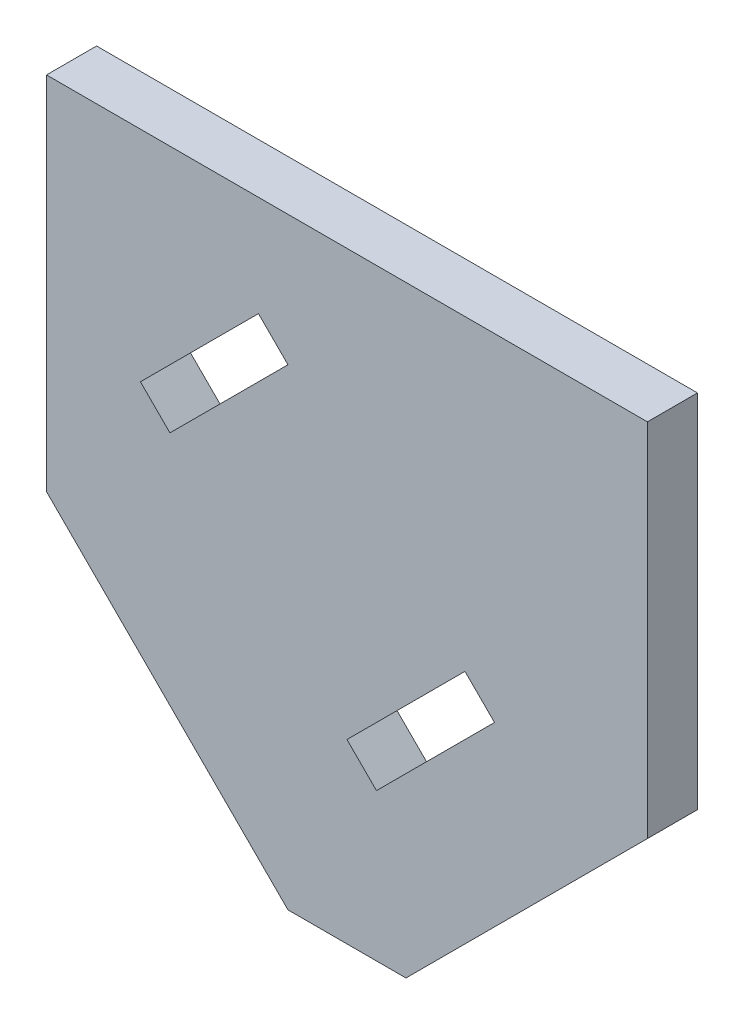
ISO-10303-21;
HEADER;
FILE_DESCRIPTION(('STEP AP214'),'2;1');
FILE_NAME('part.step','',(''),(''),'','','');
FILE_SCHEMA(('AUTOMOTIVE_DESIGN { 1 0 10303 214 1 1 1 1 }'));
ENDSEC;
DATA;
#1=APPLICATION_CONTEXT('core data for automotive mechanical design processes');
#2=APPLICATION_PROTOCOL_DEFINITION('international standard','automotive_design',2000,#1);
#3=PRODUCT_CONTEXT('',#1,'mechanical');
#4=PRODUCT('Part','Part','',(#3));
#5=PRODUCT_RELATED_PRODUCT_CATEGORY('part','',(#4));
#6=PRODUCT_DEFINITION_FORMATION('','',#4);
#7=PRODUCT_DEFINITION_CONTEXT('part definition',#1,'design');
#8=PRODUCT_DEFINITION('design','',#6,#7);
#9=PRODUCT_DEFINITION_SHAPE('','',#8);
#10=(LENGTH_UNIT() NAMED_UNIT(*) SI_UNIT(.MILLI.,.METRE.));
#11=(NAMED_UNIT(*) PLANE_ANGLE_UNIT() SI_UNIT($,.RADIAN.));
#12=(NAMED_UNIT(*) SI_UNIT($,.STERADIAN.) SOLID_ANGLE_UNIT());
#13=UNCERTAINTY_MEASURE_WITH_UNIT(LENGTH_MEASURE(1.E-05),#10,'distance_accuracy_value','');
#14=(GEOMETRIC_REPRESENTATION_CONTEXT(3) GLOBAL_UNCERTAINTY_ASSIGNED_CONTEXT((#13)) GLOBAL_UNIT_ASSIGNED_CONTEXT((#10,
#11,#12)) REPRESENTATION_CONTEXT('',''));
#15=CARTESIAN_POINT('',(0.,0.,0.));
#16=DIRECTION('',(0.,0.,1.));
#17=DIRECTION('',(1.,0.,0.));
#18=AXIS2_PLACEMENT_3D('',#15,#16,#17);
#19=CARTESIAN_POINT('',(-18.,21.6256246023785,3.));
#20=DIRECTION('',(1.,0.,0.));
#21=DIRECTION('',(0.,1.,0.));
#22=AXIS2_PLACEMENT_3D('',#19,#20,#21);
#23=PLANE('',#22);
#24=DIRECTION('',(0.,-1.,0.));
#25=VECTOR('',#24,1.);
#26=CARTESIAN_POINT('',(-18.,21.6256246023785,0.));
#27=LINE('',#26,#25);
#28=CARTESIAN_POINT('',(-18.,21.6256246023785,0.));
#29=VERTEX_POINT('',#28);
#30=CARTESIAN_POINT('',(-18.,1.97758476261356E-13,0.));
#31=VERTEX_POINT('',#30);
#32=EDGE_CURVE('E175',#29,#31,#27,.T.);
#33=ORIENTED_EDGE('',*,*,#32,.T.);
#34=DIRECTION('',(0.,0.,-1.));
#35=VECTOR('',#34,1.);
#36=CARTESIAN_POINT('',(-18.,1.97758476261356E-13,3.));
#37=LINE('',#36,#35);
#38=CARTESIAN_POINT('',(-18.,1.97758476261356E-13,3.));
#39=VERTEX_POINT('',#38);
#40=EDGE_CURVE('E241',#39,#31,#37,.T.);
#41=ORIENTED_EDGE('',*,*,#40,.F.);
#42=DIRECTION('',(0.,-1.,0.));
#43=VECTOR('',#42,1.);
#44=CARTESIAN_POINT('',(-18.,21.6256246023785,3.));
#45=LINE('',#44,#43);
#46=CARTESIAN_POINT('',(-18.,21.6256246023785,3.));
#47=VERTEX_POINT('',#46);
#48=EDGE_CURVE('E210',#47,#39,#45,.T.);
#49=ORIENTED_EDGE('',*,*,#48,.F.);
#50=DIRECTION('',(0.,0.,-1.));
#51=VECTOR('',#50,1.);
#52=CARTESIAN_POINT('',(-18.,21.6256246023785,3.));
#53=LINE('',#52,#51);
#54=EDGE_CURVE('E222',#47,#29,#53,.T.);
#55=ORIENTED_EDGE('',*,*,#54,.T.);
#56=EDGE_LOOP('',(#33,#41,#49,#55));
#57=FACE_BOUND('',#56,.T.);
#58=ADVANCED_FACE('F35',(#57),#23,.F.);
#59=CARTESIAN_POINT('',(-18.,1.97758476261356E-13,3.));
#60=DIRECTION('',(0.707106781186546,0.707106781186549,0.));
#61=DIRECTION('',(-0.707106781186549,0.707106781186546,0.));
#62=AXIS2_PLACEMENT_3D('',#59,#60,#61);
#63=PLANE('',#62);
#64=DIRECTION('',(0.707106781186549,-0.707106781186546,0.));
#65=VECTOR('',#64,1.);
#66=CARTESIAN_POINT('',(-18.,1.97758476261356E-13,0.));
#67=LINE('',#66,#65);
#68=CARTESIAN_POINT('',(-3.53553390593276,-14.464466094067,0.));
#69=VERTEX_POINT('',#68);
#70=EDGE_CURVE('E225',#31,#69,#67,.T.);
#71=ORIENTED_EDGE('',*,*,#70,.T.);
#72=DIRECTION('',(0.,0.,1.));
#73=VECTOR('',#72,1.);
#74=CARTESIAN_POINT('',(-3.53553390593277,-14.464466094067,3.));
#75=LINE('',#74,#73);
#76=CARTESIAN_POINT('',(-3.53553390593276,-14.464466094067,3.));
#77=VERTEX_POINT('',#76);
#78=EDGE_CURVE('E43',#69,#77,#75,.T.);
#79=ORIENTED_EDGE('',*,*,#78,.T.);
#80=DIRECTION('',(0.707106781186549,-0.707106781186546,0.));
#81=VECTOR('',#80,1.);
#82=CARTESIAN_POINT('',(-18.,1.97758476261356E-13,3.));
#83=LINE('',#82,#81);
#84=EDGE_CURVE('E213',#39,#77,#83,.T.);
#85=ORIENTED_EDGE('',*,*,#84,.F.);
#86=ORIENTED_EDGE('',*,*,#40,.T.);
#87=EDGE_LOOP('',(#71,#79,#85,#86));
#88=FACE_BOUND('',#87,.T.);
#89=ADVANCED_FACE('F275',(#88),#63,.F.);
#90=CARTESIAN_POINT('',(0.,-17.9999999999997,3.));
#91=DIRECTION('',(-0.707106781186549,0.707106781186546,0.));
#92=DIRECTION('',(-0.707106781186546,-0.707106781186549,0.));
#93=AXIS2_PLACEMENT_3D('',#90,#91,#92);
#94=PLANE('',#93);
#95=DIRECTION('',(0.707106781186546,0.707106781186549,0.));
#96=VECTOR('',#95,1.);
#97=CARTESIAN_POINT('',(0.,-17.9999999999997,3.));
#98=LINE('',#97,#96);
#99=CARTESIAN_POINT('',(3.53553390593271,-14.464466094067,3.));
#100=VERTEX_POINT('',#99);
#101=CARTESIAN_POINT('',(18.,3.71230823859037E-13,3.));
#102=VERTEX_POINT('',#101);
#103=EDGE_CURVE('E216',#100,#102,#98,.T.);
#104=ORIENTED_EDGE('',*,*,#103,.F.);
#105=DIRECTION('',(0.,0.,-1.));
#106=VECTOR('',#105,1.);
#107=CARTESIAN_POINT('',(3.53553390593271,-14.464466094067,3.));
#108=LINE('',#107,#106);
#109=CARTESIAN_POINT('',(3.53553390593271,-14.464466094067,0.));
#110=VERTEX_POINT('',#109);
#111=EDGE_CURVE('E244',#100,#110,#108,.T.);
#112=ORIENTED_EDGE('',*,*,#111,.T.);
#113=DIRECTION('',(0.707106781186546,0.707106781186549,0.));
#114=VECTOR('',#113,1.);
#115=CARTESIAN_POINT('',(0.,-17.9999999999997,0.));
#116=LINE('',#115,#114);
#117=CARTESIAN_POINT('',(18.,3.71230823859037E-13,0.));
#118=VERTEX_POINT('',#117);
#119=EDGE_CURVE('E227',#110,#118,#116,.T.);
#120=ORIENTED_EDGE('',*,*,#119,.T.);
#121=DIRECTION('',(0.,0.,-1.));
#122=VECTOR('',#121,1.);
#123=CARTESIAN_POINT('',(18.,3.71230823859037E-13,3.));
#124=LINE('',#123,#122);
#125=EDGE_CURVE('E238',#102,#118,#124,.T.);
#126=ORIENTED_EDGE('',*,*,#125,.F.);
#127=EDGE_LOOP('',(#104,#112,#120,#126));
#128=FACE_BOUND('',#127,.T.);
#129=ADVANCED_FACE('F250',(#128),#94,.F.);
#130=CARTESIAN_POINT('',(18.,3.71230823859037E-13,3.));
#131=DIRECTION('',(-1.,0.,0.));
#132=DIRECTION('',(0.,0.,1.));
#133=AXIS2_PLACEMENT_3D('',#130,#131,#132);
#134=PLANE('',#133);
#135=DIRECTION('',(0.,1.,0.));
#136=VECTOR('',#135,1.);
#137=CARTESIAN_POINT('',(18.,3.71230823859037E-13,0.));
#138=LINE('',#137,#136);
#139=CARTESIAN_POINT('',(18.,21.6256246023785,0.));
#140=VERTEX_POINT('',#139);
#141=EDGE_CURVE('E229',#118,#140,#138,.T.);
#142=ORIENTED_EDGE('',*,*,#141,.T.);
#143=DIRECTION('',(0.,0.,-1.));
#144=VECTOR('',#143,1.);
#145=CARTESIAN_POINT('',(18.,21.6256246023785,3.));
#146=LINE('',#145,#144);
#147=CARTESIAN_POINT('',(18.,21.6256246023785,3.));
#148=VERTEX_POINT('',#147);
#149=EDGE_CURVE('E235',#148,#140,#146,.T.);
#150=ORIENTED_EDGE('',*,*,#149,.F.);
#151=DIRECTION('',(0.,1.,0.));
#152=VECTOR('',#151,1.);
#153=CARTESIAN_POINT('',(18.,3.71230823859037E-13,3.));
#154=LINE('',#153,#152);
#155=EDGE_CURVE('E218',#102,#148,#154,.T.);
#156=ORIENTED_EDGE('',*,*,#155,.F.);
#157=ORIENTED_EDGE('',*,*,#125,.T.);
#158=EDGE_LOOP('',(#142,#150,#156,#157));
#159=FACE_BOUND('',#158,.T.);
#160=ADVANCED_FACE('F258',(#159),#134,.F.);
#161=CARTESIAN_POINT('',(-18.,21.6256246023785,3.));
#162=DIRECTION('',(0.,-1.,0.));
#163=DIRECTION('',(1.,0.,0.));
#164=AXIS2_PLACEMENT_3D('',#161,#162,#163);
#165=PLANE('',#164);
#166=DIRECTION('',(-1.,0.,0.));
#167=VECTOR('',#166,1.);
#168=CARTESIAN_POINT('',(-18.,21.6256246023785,0.));
#169=LINE('',#168,#167);
#170=EDGE_CURVE('E214',#140,#29,#169,.T.);
#171=ORIENTED_EDGE('',*,*,#170,.T.);
#172=ORIENTED_EDGE('',*,*,#54,.F.);
#173=DIRECTION('',(-1.,0.,0.));
#174=VECTOR('',#173,1.);
#175=CARTESIAN_POINT('',(18.,21.6256246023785,3.));
#176=LINE('',#175,#174);
#177=EDGE_CURVE('E220',#148,#47,#176,.T.);
#178=ORIENTED_EDGE('',*,*,#177,.F.);
#179=ORIENTED_EDGE('',*,*,#149,.T.);
#180=EDGE_LOOP('',(#171,#172,#178,#179));
#181=FACE_BOUND('',#180,.T.);
#182=ADVANCED_FACE('F262',(#181),#165,.F.);
#183=CARTESIAN_POINT('',(0.,0.,3.));
#184=DIRECTION('',(0.,0.,-1.));
#185=DIRECTION('',(-1.,0.,0.));
#186=AXIS2_PLACEMENT_3D('',#183,#184,#185);
#187=PLANE('',#186);
#188=DIRECTION('',(-0.707106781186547,-0.707106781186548,0.));
#189=VECTOR('',#188,1.);
#190=CARTESIAN_POINT('',(7.07106781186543,3.21320343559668,3.));
#191=LINE('',#190,#189);
#192=CARTESIAN_POINT('',(7.07106781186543,3.21320343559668,3.));
#193=VERTEX_POINT('',#192);
#194=CARTESIAN_POINT('',(0.,-3.8578643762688,3.));
#195=VERTEX_POINT('',#194);
#196=EDGE_CURVE('E168',#193,#195,#191,.T.);
#197=ORIENTED_EDGE('',*,*,#196,.F.);
#198=DIRECTION('',(-0.707106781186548,0.707106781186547,0.));
#199=VECTOR('',#198,1.);
#200=CARTESIAN_POINT('',(8.83883476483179,1.44543648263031,3.));
#201=LINE('',#200,#199);
#202=CARTESIAN_POINT('',(8.83883476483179,1.44543648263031,3.));
#203=VERTEX_POINT('',#202);
#204=EDGE_CURVE('E141',#203,#193,#201,.T.);
#205=ORIENTED_EDGE('',*,*,#204,.F.);
#206=DIRECTION('',(0.707106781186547,0.707106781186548,0.));
#207=VECTOR('',#206,1.);
#208=CARTESIAN_POINT('',(8.83883476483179,1.44543648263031,3.));
#209=LINE('',#208,#207);
#210=CARTESIAN_POINT('',(1.76776695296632,-5.62563132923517,3.));
#211=VERTEX_POINT('',#210);
#212=EDGE_CURVE('E159',#211,#203,#209,.T.);
#213=ORIENTED_EDGE('',*,*,#212,.F.);
#214=DIRECTION('',(0.707106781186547,-0.707106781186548,0.));
#215=VECTOR('',#214,1.);
#216=CARTESIAN_POINT('',(0.,-3.8578643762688,3.));
#217=LINE('',#216,#215);
#218=EDGE_CURVE('E162',#195,#211,#217,.T.);
#219=ORIENTED_EDGE('',*,*,#218,.F.);
#220=EDGE_LOOP('',(#197,#205,#213,#219));
#221=FACE_BOUND('',#220,.T.);
#222=DIRECTION('',(0.707106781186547,0.707106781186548,0.));
#223=VECTOR('',#222,1.);
#224=CARTESIAN_POINT('',(-3.53553390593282,13.8198051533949,3.));
#225=LINE('',#224,#223);
#226=CARTESIAN_POINT('',(-10.6066017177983,6.74873734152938,3.));
#227=VERTEX_POINT('',#226);
#228=CARTESIAN_POINT('',(-3.53553390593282,13.8198051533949,3.));
#229=VERTEX_POINT('',#228);
#230=EDGE_CURVE('E195',#227,#229,#225,.T.);
#231=ORIENTED_EDGE('',*,*,#230,.F.);
#232=DIRECTION('',(0.707106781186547,-0.707106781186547,0.));
#233=VECTOR('',#232,1.);
#234=CARTESIAN_POINT('',(-10.6066017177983,6.74873734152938,3.));
#235=LINE('',#234,#233);
#236=CARTESIAN_POINT('',(-12.3743686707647,8.51650429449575,3.));
#237=VERTEX_POINT('',#236);
#238=EDGE_CURVE('E193',#237,#227,#235,.T.);
#239=ORIENTED_EDGE('',*,*,#238,.F.);
#240=DIRECTION('',(-0.707106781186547,-0.707106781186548,0.));
#241=VECTOR('',#240,1.);
#242=CARTESIAN_POINT('',(-12.3743686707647,8.51650429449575,3.));
#243=LINE('',#242,#241);
#244=CARTESIAN_POINT('',(-5.30330085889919,15.5875721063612,3.));
#245=VERTEX_POINT('',#244);
#246=EDGE_CURVE('E183',#245,#237,#243,.T.);
#247=ORIENTED_EDGE('',*,*,#246,.F.);
#248=DIRECTION('',(-0.707106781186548,0.707106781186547,0.));
#249=VECTOR('',#248,1.);
#250=CARTESIAN_POINT('',(-5.30330085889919,15.5875721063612,3.));
#251=LINE('',#250,#249);
#252=EDGE_CURVE('E198',#229,#245,#251,.T.);
#253=ORIENTED_EDGE('',*,*,#252,.F.);
#254=EDGE_LOOP('',(#231,#239,#247,#253));
#255=FACE_BOUND('',#254,.T.);
#256=ORIENTED_EDGE('',*,*,#84,.T.);
#257=DIRECTION('',(-1.,0.,0.));
#258=VECTOR('',#257,1.);
#259=CARTESIAN_POINT('',(3.53553390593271,-14.464466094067,3.));
#260=LINE('',#259,#258);
#261=EDGE_CURVE('E11',#77,#100,#260,.F.);
#262=ORIENTED_EDGE('',*,*,#261,.T.);
#263=ORIENTED_EDGE('',*,*,#103,.T.);
#264=ORIENTED_EDGE('',*,*,#155,.T.);
#265=ORIENTED_EDGE('',*,*,#177,.T.);
#266=ORIENTED_EDGE('',*,*,#48,.T.);
#267=EDGE_LOOP('',(#256,#262,#263,#264,#265,#266));
#268=FACE_BOUND('',#267,.T.);
#269=ADVANCED_FACE('F266',(#221,#255,#268),#187,.F.);
#270=CARTESIAN_POINT('',(0.,0.,0.));
#271=DIRECTION('',(0.,0.,-1.));
#272=DIRECTION('',(-1.,0.,0.));
#273=AXIS2_PLACEMENT_3D('',#270,#271,#272);
#274=PLANE('',#273);
#275=DIRECTION('',(-0.707106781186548,0.707106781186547,0.));
#276=VECTOR('',#275,1.);
#277=CARTESIAN_POINT('',(8.83883476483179,1.44543648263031,0.));
#278=LINE('',#277,#276);
#279=CARTESIAN_POINT('',(8.83883476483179,1.44543648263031,0.));
#280=VERTEX_POINT('',#279);
#281=CARTESIAN_POINT('',(7.07106781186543,3.21320343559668,0.));
#282=VERTEX_POINT('',#281);
#283=EDGE_CURVE('E138',#280,#282,#278,.T.);
#284=ORIENTED_EDGE('',*,*,#283,.T.);
#285=DIRECTION('',(-0.707106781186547,-0.707106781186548,0.));
#286=VECTOR('',#285,1.);
#287=CARTESIAN_POINT('',(7.07106781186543,3.21320343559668,0.));
#288=LINE('',#287,#286);
#289=CARTESIAN_POINT('',(0.,-3.8578643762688,0.));
#290=VERTEX_POINT('',#289);
#291=EDGE_CURVE('E150',#282,#290,#288,.T.);
#292=ORIENTED_EDGE('',*,*,#291,.T.);
#293=DIRECTION('',(0.707106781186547,-0.707106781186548,0.));
#294=VECTOR('',#293,1.);
#295=CARTESIAN_POINT('',(0.,-3.8578643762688,0.));
#296=LINE('',#295,#294);
#297=CARTESIAN_POINT('',(1.76776695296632,-5.62563132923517,0.));
#298=VERTEX_POINT('',#297);
#299=EDGE_CURVE('E154',#290,#298,#296,.T.);
#300=ORIENTED_EDGE('',*,*,#299,.T.);
#301=DIRECTION('',(0.707106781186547,0.707106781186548,0.));
#302=VECTOR('',#301,1.);
#303=CARTESIAN_POINT('',(8.83883476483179,1.44543648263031,0.));
#304=LINE('',#303,#302);
#305=EDGE_CURVE('E146',#298,#280,#304,.T.);
#306=ORIENTED_EDGE('',*,*,#305,.T.);
#307=EDGE_LOOP('',(#284,#292,#300,#306));
#308=FACE_BOUND('',#307,.T.);
#309=DIRECTION('',(0.707106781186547,-0.707106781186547,0.));
#310=VECTOR('',#309,1.);
#311=CARTESIAN_POINT('',(-10.6066017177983,6.74873734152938,0.));
#312=LINE('',#311,#310);
#313=CARTESIAN_POINT('',(-12.3743686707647,8.51650429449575,0.));
#314=VERTEX_POINT('',#313);
#315=CARTESIAN_POINT('',(-10.6066017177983,6.74873734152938,0.));
#316=VERTEX_POINT('',#315);
#317=EDGE_CURVE('E179',#314,#316,#312,.T.);
#318=ORIENTED_EDGE('',*,*,#317,.T.);
#319=DIRECTION('',(0.707106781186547,0.707106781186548,0.));
#320=VECTOR('',#319,1.);
#321=CARTESIAN_POINT('',(-3.53553390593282,13.8198051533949,0.));
#322=LINE('',#321,#320);
#323=CARTESIAN_POINT('',(-3.53553390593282,13.8198051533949,0.));
#324=VERTEX_POINT('',#323);
#325=EDGE_CURVE('E182',#316,#324,#322,.T.);
#326=ORIENTED_EDGE('',*,*,#325,.T.);
#327=DIRECTION('',(-0.707106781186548,0.707106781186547,0.));
#328=VECTOR('',#327,1.);
#329=CARTESIAN_POINT('',(-5.30330085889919,15.5875721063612,0.));
#330=LINE('',#329,#328);
#331=CARTESIAN_POINT('',(-5.30330085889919,15.5875721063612,0.));
#332=VERTEX_POINT('',#331);
#333=EDGE_CURVE('E186',#324,#332,#330,.T.);
#334=ORIENTED_EDGE('',*,*,#333,.T.);
#335=DIRECTION('',(-0.707106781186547,-0.707106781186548,0.));
#336=VECTOR('',#335,1.);
#337=CARTESIAN_POINT('',(-12.3743686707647,8.51650429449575,0.));
#338=LINE('',#337,#336);
#339=EDGE_CURVE('E189',#332,#314,#338,.T.);
#340=ORIENTED_EDGE('',*,*,#339,.T.);
#341=EDGE_LOOP('',(#318,#326,#334,#340));
#342=FACE_BOUND('',#341,.T.);
#343=ORIENTED_EDGE('',*,*,#119,.F.);
#344=DIRECTION('',(1.,0.,0.));
#345=VECTOR('',#344,1.);
#346=CARTESIAN_POINT('',(0.,-14.464466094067,0.));
#347=LINE('',#346,#345);
#348=EDGE_CURVE('E57',#110,#69,#347,.F.);
#349=ORIENTED_EDGE('',*,*,#348,.T.);
#350=ORIENTED_EDGE('',*,*,#70,.F.);
#351=ORIENTED_EDGE('',*,*,#32,.F.);
#352=ORIENTED_EDGE('',*,*,#170,.F.);
#353=ORIENTED_EDGE('',*,*,#141,.F.);
#354=EDGE_LOOP('',(#343,#349,#350,#351,#352,#353));
#355=FACE_BOUND('',#354,.T.);
#356=ADVANCED_FACE('F156',(#308,#342,#355),#274,.T.);
#357=CARTESIAN_POINT('',(-10.6066017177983,6.74873734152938,0.));
#358=DIRECTION('',(-0.707106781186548,-0.707106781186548,0.));
#359=DIRECTION('',(0.707106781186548,-0.707106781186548,0.));
#360=AXIS2_PLACEMENT_3D('',#357,#358,#359);
#361=PLANE('',#360);
#362=ORIENTED_EDGE('',*,*,#238,.T.);
#363=DIRECTION('',(0.,0.,1.));
#364=VECTOR('',#363,1.);
#365=CARTESIAN_POINT('',(-10.6066017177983,6.74873734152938,0.));
#366=LINE('',#365,#364);
#367=EDGE_CURVE('E192',#316,#227,#366,.T.);
#368=ORIENTED_EDGE('',*,*,#367,.F.);
#369=ORIENTED_EDGE('',*,*,#317,.F.);
#370=DIRECTION('',(0.,0.,1.));
#371=VECTOR('',#370,1.);
#372=CARTESIAN_POINT('',(-12.3743686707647,8.51650429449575,0.));
#373=LINE('',#372,#371);
#374=EDGE_CURVE('E169',#314,#237,#373,.T.);
#375=ORIENTED_EDGE('',*,*,#374,.T.);
#376=EDGE_LOOP('',(#362,#368,#369,#375));
#377=FACE_BOUND('',#376,.T.);
#378=ADVANCED_FACE('F290',(#377),#361,.F.);
#379=CARTESIAN_POINT('',(-12.3743686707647,8.51650429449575,0.));
#380=DIRECTION('',(-0.707106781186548,0.707106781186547,0.));
#381=DIRECTION('',(-0.707106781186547,-0.707106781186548,0.));
#382=AXIS2_PLACEMENT_3D('',#379,#380,#381);
#383=PLANE('',#382);
#384=ORIENTED_EDGE('',*,*,#246,.T.);
#385=ORIENTED_EDGE('',*,*,#374,.F.);
#386=ORIENTED_EDGE('',*,*,#339,.F.);
#387=DIRECTION('',(0.,0.,1.));
#388=VECTOR('',#387,1.);
#389=CARTESIAN_POINT('',(-5.30330085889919,15.5875721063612,0.));
#390=LINE('',#389,#388);
#391=EDGE_CURVE('E204',#332,#245,#390,.T.);
#392=ORIENTED_EDGE('',*,*,#391,.T.);
#393=EDGE_LOOP('',(#384,#385,#386,#392));
#394=FACE_BOUND('',#393,.T.);
#395=ADVANCED_FACE('F296',(#394),#383,.F.);
#396=CARTESIAN_POINT('',(-5.30330085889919,15.5875721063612,0.));
#397=DIRECTION('',(0.707106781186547,0.707106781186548,0.));
#398=DIRECTION('',(-0.707106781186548,0.707106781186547,0.));
#399=AXIS2_PLACEMENT_3D('',#396,#397,#398);
#400=PLANE('',#399);
#401=ORIENTED_EDGE('',*,*,#252,.T.);
#402=ORIENTED_EDGE('',*,*,#391,.F.);
#403=ORIENTED_EDGE('',*,*,#333,.F.);
#404=DIRECTION('',(0.,0.,1.));
#405=VECTOR('',#404,1.);
#406=CARTESIAN_POINT('',(-3.53553390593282,13.8198051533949,0.));
#407=LINE('',#406,#405);
#408=EDGE_CURVE('E206',#324,#229,#407,.T.);
#409=ORIENTED_EDGE('',*,*,#408,.T.);
#410=EDGE_LOOP('',(#401,#402,#403,#409));
#411=FACE_BOUND('',#410,.T.);
#412=ADVANCED_FACE('F301',(#411),#400,.F.);
#413=CARTESIAN_POINT('',(-3.53553390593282,13.8198051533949,0.));
#414=DIRECTION('',(0.707106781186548,-0.707106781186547,0.));
#415=DIRECTION('',(0.707106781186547,0.707106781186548,0.));
#416=AXIS2_PLACEMENT_3D('',#413,#414,#415);
#417=PLANE('',#416);
#418=ORIENTED_EDGE('',*,*,#230,.T.);
#419=ORIENTED_EDGE('',*,*,#408,.F.);
#420=ORIENTED_EDGE('',*,*,#325,.F.);
#421=ORIENTED_EDGE('',*,*,#367,.T.);
#422=EDGE_LOOP('',(#418,#419,#420,#421));
#423=FACE_BOUND('',#422,.T.);
#424=ADVANCED_FACE('F298',(#423),#417,.F.);
#425=CARTESIAN_POINT('',(8.83883476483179,1.44543648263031,0.));
#426=DIRECTION('',(0.707106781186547,0.707106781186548,0.));
#427=DIRECTION('',(-0.707106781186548,0.707106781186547,0.));
#428=AXIS2_PLACEMENT_3D('',#425,#426,#427);
#429=PLANE('',#428);
#430=ORIENTED_EDGE('',*,*,#204,.T.);
#431=DIRECTION('',(0.,0.,1.));
#432=VECTOR('',#431,1.);
#433=CARTESIAN_POINT('',(7.07106781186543,3.21320343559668,0.));
#434=LINE('',#433,#432);
#435=EDGE_CURVE('E134',#282,#193,#434,.T.);
#436=ORIENTED_EDGE('',*,*,#435,.F.);
#437=ORIENTED_EDGE('',*,*,#283,.F.);
#438=DIRECTION('',(0.,0.,1.));
#439=VECTOR('',#438,1.);
#440=CARTESIAN_POINT('',(8.83883476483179,1.44543648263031,0.));
#441=LINE('',#440,#439);
#442=EDGE_CURVE('E173',#280,#203,#441,.T.);
#443=ORIENTED_EDGE('',*,*,#442,.T.);
#444=EDGE_LOOP('',(#430,#436,#437,#443));
#445=FACE_BOUND('',#444,.T.);
#446=ADVANCED_FACE('F136',(#445),#429,.F.);
#447=CARTESIAN_POINT('',(8.83883476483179,1.44543648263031,0.));
#448=DIRECTION('',(0.707106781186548,-0.707106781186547,0.));
#449=DIRECTION('',(0.707106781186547,0.707106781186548,0.));
#450=AXIS2_PLACEMENT_3D('',#447,#448,#449);
#451=PLANE('',#450);
#452=ORIENTED_EDGE('',*,*,#212,.T.);
#453=ORIENTED_EDGE('',*,*,#442,.F.);
#454=ORIENTED_EDGE('',*,*,#305,.F.);
#455=DIRECTION('',(0.,0.,1.));
#456=VECTOR('',#455,1.);
#457=CARTESIAN_POINT('',(1.76776695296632,-5.62563132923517,0.));
#458=LINE('',#457,#456);
#459=EDGE_CURVE('E176',#298,#211,#458,.T.);
#460=ORIENTED_EDGE('',*,*,#459,.T.);
#461=EDGE_LOOP('',(#452,#453,#454,#460));
#462=FACE_BOUND('',#461,.T.);
#463=ADVANCED_FACE('F310',(#462),#451,.F.);
#464=CARTESIAN_POINT('',(0.,-3.8578643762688,0.));
#465=DIRECTION('',(-0.707106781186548,-0.707106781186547,0.));
#466=DIRECTION('',(0.707106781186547,-0.707106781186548,0.));
#467=AXIS2_PLACEMENT_3D('',#464,#465,#466);
#468=PLANE('',#467);
#469=ORIENTED_EDGE('',*,*,#218,.T.);
#470=ORIENTED_EDGE('',*,*,#459,.F.);
#471=ORIENTED_EDGE('',*,*,#299,.F.);
#472=DIRECTION('',(0.,0.,1.));
#473=VECTOR('',#472,1.);
#474=CARTESIAN_POINT('',(0.,-3.8578643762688,0.));
#475=LINE('',#474,#473);
#476=EDGE_CURVE('E145',#290,#195,#475,.T.);
#477=ORIENTED_EDGE('',*,*,#476,.T.);
#478=EDGE_LOOP('',(#469,#470,#471,#477));
#479=FACE_BOUND('',#478,.T.);
#480=ADVANCED_FACE('F272',(#479),#468,.F.);
#481=CARTESIAN_POINT('',(7.07106781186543,3.21320343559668,0.));
#482=DIRECTION('',(-0.707106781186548,0.707106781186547,0.));
#483=DIRECTION('',(-0.707106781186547,-0.707106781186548,0.));
#484=AXIS2_PLACEMENT_3D('',#481,#482,#483);
#485=PLANE('',#484);
#486=ORIENTED_EDGE('',*,*,#196,.T.);
#487=ORIENTED_EDGE('',*,*,#476,.F.);
#488=ORIENTED_EDGE('',*,*,#291,.F.);
#489=ORIENTED_EDGE('',*,*,#435,.T.);
#490=EDGE_LOOP('',(#486,#487,#488,#489));
#491=FACE_BOUND('',#490,.T.);
#492=ADVANCED_FACE('F151',(#491),#485,.F.);
#493=CARTESIAN_POINT('',(3.53553390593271,-14.464466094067,3.));
#494=DIRECTION('',(0.,1.,0.));
#495=DIRECTION('',(0.,0.,-1.));
#496=AXIS2_PLACEMENT_3D('',#493,#494,#495);
#497=PLANE('',#496);
#498=ORIENTED_EDGE('',*,*,#261,.F.);
#499=ORIENTED_EDGE('',*,*,#78,.F.);
#500=ORIENTED_EDGE('',*,*,#348,.F.);
#501=ORIENTED_EDGE('',*,*,#111,.F.);
#502=EDGE_LOOP('',(#498,#499,#500,#501));
#503=FACE_BOUND('',#502,.T.);
#504=ADVANCED_FACE('F37',(#503),#497,.F.);
#505=CLOSED_SHELL('',(#58,#89,#129,#160,#182,#269,#356,#378,#395,#412,#424,#446,#463,#480,#492,#504));
#506=MANIFOLD_SOLID_BREP('B2',#505);
#507=ADVANCED_BREP_SHAPE_REPRESENTATION('',(#18,#506),#14);
#508=SHAPE_DEFINITION_REPRESENTATION(#9,#507);
ENDSEC;
END-ISO-10303-21;
